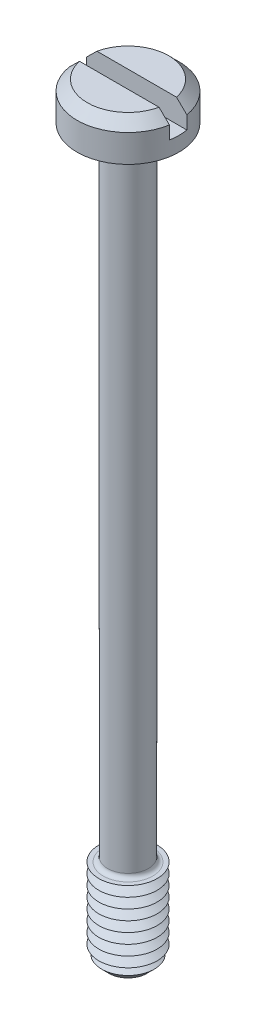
ISO-10303-21;
HEADER;
FILE_DESCRIPTION(('STEP AP214'),'2;1');
FILE_NAME('part.step','',(''),(''),'','','');
FILE_SCHEMA(('AUTOMOTIVE_DESIGN { 1 0 10303 214 1 1 1 1 }'));
ENDSEC;
DATA;
#1=APPLICATION_CONTEXT('core data for automotive mechanical design processes');
#2=APPLICATION_PROTOCOL_DEFINITION('international standard','automotive_design',2000,#1);
#3=PRODUCT_CONTEXT('',#1,'mechanical');
#4=PRODUCT('Part','Part','',(#3));
#5=PRODUCT_RELATED_PRODUCT_CATEGORY('part','',(#4));
#6=PRODUCT_DEFINITION_FORMATION('','',#4);
#7=PRODUCT_DEFINITION_CONTEXT('part definition',#1,'design');
#8=PRODUCT_DEFINITION('design','',#6,#7);
#9=PRODUCT_DEFINITION_SHAPE('','',#8);
#10=(LENGTH_UNIT() NAMED_UNIT(*) SI_UNIT(.MILLI.,.METRE.));
#11=(NAMED_UNIT(*) PLANE_ANGLE_UNIT() SI_UNIT($,.RADIAN.));
#12=(NAMED_UNIT(*) SI_UNIT($,.STERADIAN.) SOLID_ANGLE_UNIT());
#13=UNCERTAINTY_MEASURE_WITH_UNIT(LENGTH_MEASURE(1.E-05),#10,'distance_accuracy_value','');
#14=(GEOMETRIC_REPRESENTATION_CONTEXT(3) GLOBAL_UNCERTAINTY_ASSIGNED_CONTEXT((#13)) GLOBAL_UNIT_ASSIGNED_CONTEXT((#10,
#11,#12)) REPRESENTATION_CONTEXT('',''));
#15=CARTESIAN_POINT('',(0.,0.,0.));
#16=DIRECTION('',(0.,0.,1.));
#17=DIRECTION('',(1.,0.,0.));
#18=AXIS2_PLACEMENT_3D('',#15,#16,#17);
#19=CARTESIAN_POINT('',(0.,2.6,0.));
#20=DIRECTION('',(0.,1.,0.));
#21=DIRECTION('',(0.,0.,1.));
#22=AXIS2_PLACEMENT_3D('',#19,#20,#21);
#23=PLANE('',#22);
#24=DIRECTION('',(-1.,0.,0.));
#25=VECTOR('',#24,1.);
#26=CARTESIAN_POINT('',(3.5,2.6,-0.6));
#27=LINE('',#26,#25);
#28=CARTESIAN_POINT('',(2.73495886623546,2.6,-0.6));
#29=VERTEX_POINT('',#28);
#30=CARTESIAN_POINT('',(-2.73495886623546,2.6,-0.6));
#31=VERTEX_POINT('',#30);
#32=EDGE_CURVE('E110',#29,#31,#27,.T.);
#33=ORIENTED_EDGE('',*,*,#32,.F.);
#34=CARTESIAN_POINT('',(0.,2.6,0.));
#35=DIRECTION('',(0.,1.,0.));
#36=DIRECTION('',(0.,0.,1.));
#37=AXIS2_PLACEMENT_3D('',#34,#35,#36);
#38=CIRCLE('',#37,2.8);
#39=EDGE_CURVE('E113',#29,#31,#38,.T.);
#40=ORIENTED_EDGE('',*,*,#39,.T.);
#41=EDGE_LOOP('',(#33,#40));
#42=FACE_BOUND('',#41,.T.);
#43=ADVANCED_FACE('F39',(#42),#23,.T.);
#44=CARTESIAN_POINT('',(0.,2.6,0.));
#45=DIRECTION('',(0.,-1.,0.));
#46=DIRECTION('',(0.,0.,-1.));
#47=AXIS2_PLACEMENT_3D('',#44,#45,#46);
#48=CONICAL_SURFACE('',#47,2.8,0.785398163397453);
#49=CARTESIAN_POINT('',(7.69779986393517,-2.32114776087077,-0.6));
#50=CARTESIAN_POINT('',(7.4245634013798,-2.0487448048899,-0.6));
#51=CARTESIAN_POINT('',(7.15128998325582,-1.77637887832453,-0.6));
#52=CARTESIAN_POINT('',(6.60460779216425,-1.23176088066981,-0.6));
#53=CARTESIAN_POINT('',(6.33119901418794,-0.959508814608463,-0.6));
#54=CARTESIAN_POINT('',(5.78393918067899,-0.414914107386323,-0.6));
#55=CARTESIAN_POINT('',(5.51008795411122,-0.14257163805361,-0.6));
#56=CARTESIAN_POINT('',(4.96212493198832,0.401829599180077,-0.6));
#57=CARTESIAN_POINT('',(4.68801314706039,0.673888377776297,-0.6));
#58=CARTESIAN_POINT('',(4.15230810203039,1.204717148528,-0.6));
#59=CARTESIAN_POINT('',(3.89073524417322,1.4635077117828,-0.6));
#60=CARTESIAN_POINT('',(3.49781694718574,1.85115830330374,-0.6));
#61=CARTESIAN_POINT('',(3.36674319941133,1.98029362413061,-0.6));
#62=CARTESIAN_POINT('',(3.10433907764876,2.23830030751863,-0.6));
#63=CARTESIAN_POINT('',(2.97300870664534,2.36717167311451,-0.6));
#64=CARTESIAN_POINT('',(2.71005235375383,2.62445652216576,-0.6));
#65=CARTESIAN_POINT('',(2.57842659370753,2.75287023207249,-0.6));
#66=CARTESIAN_POINT('',(2.31459302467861,3.00911021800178,-0.6));
#67=CARTESIAN_POINT('',(2.1823851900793,3.13693646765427,-0.6));
#68=CARTESIAN_POINT('',(1.91706128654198,3.39159289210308,-0.6));
#69=CARTESIAN_POINT('',(1.78394541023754,3.51842326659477,-0.6));
#70=CARTESIAN_POINT('',(1.58297454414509,3.70728046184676,-0.6));
#71=CARTESIAN_POINT('',(1.51577053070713,3.76999922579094,-0.6));
#72=CARTESIAN_POINT('',(1.38073587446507,3.89475766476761,-0.6));
#73=CARTESIAN_POINT('',(1.31290524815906,3.95679735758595,-0.6));
#74=CARTESIAN_POINT('',(1.2066236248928,4.05253127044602,-0.6));
#75=CARTESIAN_POINT('',(1.16849592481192,4.08658409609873,-0.6));
#76=CARTESIAN_POINT('',(1.09186306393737,4.15427097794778,-0.6));
#77=CARTESIAN_POINT('',(1.05335786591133,4.18790499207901,-0.6));
#78=CARTESIAN_POINT('',(0.975560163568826,4.25487029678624,-0.6));
#79=CARTESIAN_POINT('',(0.93626386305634,4.28819718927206,-0.6));
#80=CARTESIAN_POINT('',(0.857023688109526,4.35405392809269,-0.6));
#81=CARTESIAN_POINT('',(0.817079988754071,4.38658398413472,-0.6));
#82=CARTESIAN_POINT('',(0.735932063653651,4.45080389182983,-0.6));
#83=CARTESIAN_POINT('',(0.694719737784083,4.48248357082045,-0.6));
#84=CARTESIAN_POINT('',(0.611023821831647,4.54411116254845,-0.6));
#85=CARTESIAN_POINT('',(0.568540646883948,4.57405963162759,-0.6));
#86=CARTESIAN_POINT('',(0.482031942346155,4.6310413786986,-0.6));
#87=CARTESIAN_POINT('',(0.438018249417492,4.6580923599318,-0.6));
#88=CARTESIAN_POINT('',(0.347545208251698,4.70764477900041,-0.6));
#89=CARTESIAN_POINT('',(0.301093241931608,4.73015905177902,-0.6));
#90=CARTESIAN_POINT('',(0.216840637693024,4.76288589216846,-0.6));
#91=CARTESIAN_POINT('',(0.179711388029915,4.7747611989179,-0.6));
#92=CARTESIAN_POINT('',(0.104069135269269,4.79214056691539,-0.6));
#93=CARTESIAN_POINT('',(0.06556300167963,4.79767265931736,-0.6));
#94=CARTESIAN_POINT('',(-0.012108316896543,4.80113734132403,-0.6));
#95=CARTESIAN_POINT('',(-0.0512762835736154,4.79901215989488,-0.6));
#96=CARTESIAN_POINT('',(-0.128601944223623,4.7875810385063,-0.6));
#97=CARTESIAN_POINT('',(-0.166755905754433,4.77825158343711,-0.6));
#98=CARTESIAN_POINT('',(-0.239985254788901,4.75468984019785,-0.6));
#99=CARTESIAN_POINT('',(-0.275121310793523,4.74063623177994,-0.6));
#100=CARTESIAN_POINT('',(-0.34385962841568,4.70912771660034,-0.6));
#101=CARTESIAN_POINT('',(-0.377459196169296,4.69166709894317,-0.6));
#102=CARTESIAN_POINT('',(-0.443620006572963,4.65431398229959,-0.6));
#103=CARTESIAN_POINT('',(-0.476170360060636,4.63440256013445,-0.6));
#104=CARTESIAN_POINT('',(-0.540208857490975,4.59301144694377,-0.6));
#105=CARTESIAN_POINT('',(-0.571697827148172,4.57153301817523,-0.6));
#106=CARTESIAN_POINT('',(-0.636426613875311,4.52565712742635,-0.6));
#107=CARTESIAN_POINT('',(-0.669598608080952,4.50116466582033,-0.6));
#108=CARTESIAN_POINT('',(-0.735238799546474,4.45125092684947,-0.6));
#109=CARTESIAN_POINT('',(-0.767706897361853,4.42582951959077,-0.6));
#110=CARTESIAN_POINT('',(-0.864340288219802,4.34853769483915,-0.6));
#111=CARTESIAN_POINT('',(-0.92770092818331,4.29566444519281,-0.6));
#112=CARTESIAN_POINT('',(-1.0532203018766,4.18829389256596,-0.6));
#113=CARTESIAN_POINT('',(-1.11537654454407,4.13379371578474,-0.6));
#114=CARTESIAN_POINT('',(-1.2387980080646,4.02383276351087,-0.6));
#115=CARTESIAN_POINT('',(-1.30006349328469,3.9683722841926,-0.6));
#116=CARTESIAN_POINT('',(-1.42182653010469,3.85695373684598,-0.6));
#117=CARTESIAN_POINT('',(-1.48232573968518,3.80099747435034,-0.6));
#118=CARTESIAN_POINT('',(-1.60290045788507,3.68862177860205,-0.6));
#119=CARTESIAN_POINT('',(-1.66297593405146,3.63220231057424,-0.6));
#120=CARTESIAN_POINT('',(-1.84259490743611,3.46258196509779,-0.6));
#121=CARTESIAN_POINT('',(-1.96167258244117,3.34888831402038,-0.6));
#122=CARTESIAN_POINT('',(-2.19942862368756,3.12043467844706,-0.6));
#123=CARTESIAN_POINT('',(-2.31810499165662,3.00567262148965,-0.6));
#124=CARTESIAN_POINT('',(-2.5549851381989,2.77566147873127,-0.6));
#125=CARTESIAN_POINT('',(-2.67318891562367,2.66041239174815,-0.6));
#126=CARTESIAN_POINT('',(-3.02733776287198,2.31418176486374,-0.6));
#127=CARTESIAN_POINT('',(-3.26281496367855,2.08272206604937,-0.6));
#128=CARTESIAN_POINT('',(-3.73326607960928,1.61902814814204,-0.6));
#129=CARTESIAN_POINT('',(-3.96823963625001,1.38679356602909,-0.6));
#130=CARTESIAN_POINT('',(-4.43780370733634,0.921942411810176,-0.6));
#131=CARTESIAN_POINT('',(-4.67239422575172,0.689325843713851,-0.6));
#132=CARTESIAN_POINT('',(-5.13982382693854,0.225350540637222,-0.6));
#133=CARTESIAN_POINT('',(-5.37266445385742,-0.00600663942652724,-0.6));
#134=CARTESIAN_POINT('',(-5.83818541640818,-0.468883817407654,-0.6));
#135=CARTESIAN_POINT('',(-6.07086575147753,-0.700403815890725,-0.6));
#136=CARTESIAN_POINT('',(-6.53596926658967,-1.16341429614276,-0.6));
#137=CARTESIAN_POINT('',(-6.76839251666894,-1.39490470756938,-0.6));
#138=CARTESIAN_POINT('',(-7.23315324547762,-1.85796986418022,-0.6));
#139=CARTESIAN_POINT('',(-7.46549072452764,-2.08954460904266,-0.6));
#140=CARTESIAN_POINT('',(-7.69779986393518,-2.32114776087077,-0.6));
#141=B_SPLINE_CURVE_WITH_KNOTS('',3,(#49,#50,#51,#52,#53,#54,#55,#56,#57,#58,#59,#60,#61,#62,
#63,#64,#65,#66,#67,#68,#69,#70,#71,#72,#73,#74,#75,#76,#77,#78,#79,#80,#81,#82,#83,#84,#85,#86,
#87,#88,#89,#90,#91,#92,#93,#94,#95,#96,#97,#98,#99,#100,#101,#102,#103,#104,#105,#106,#107,
#108,#109,#110,#111,#112,#113,#114,#115,#116,#117,#118,#119,#120,#121,#122,#123,#124,#125,#126,
#127,#128,#129,#130,#131,#132,#133,#134,#135,#136,#137,#138,#139,#140),.UNSPECIFIED.,.F.,.F.,(4,
2,2,2,2,2,2,2,2,2,2,2,2,2,2,2,2,2,2,2,2,2,2,2,2,2,2,2,2,2,2,2,2,2,2,2,2,2,2,2,2,2,2,2,2,4),(0.,
1.15747738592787,2.31500139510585,3.47365747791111,4.63226817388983,5.73614050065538,
6.288142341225,6.84013779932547,7.39180548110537,7.9434976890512,8.49507629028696,
8.77084567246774,9.04660781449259,9.19996738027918,9.35334222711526,9.50791164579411,
9.66243993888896,9.81835637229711,9.97422241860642,10.1290741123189,10.2834813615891,
10.4000294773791,10.5160605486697,10.6329688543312,10.7502603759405,10.8635386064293,
10.9770083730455,11.0914168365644,11.205734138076,11.3294140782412,11.4531113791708,
11.7006314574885,11.9486181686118,12.1965297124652,12.4437540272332,12.6909970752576,
13.1849047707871,13.6801705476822,14.1754375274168,15.1659939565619,16.1571087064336,
17.1482131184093,18.1329303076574,19.1176509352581,20.1017623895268,21.0858701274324),.UNSPECIFIED.);
#142=CARTESIAN_POINT('',(3.44818792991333,1.9,-0.6));
#143=VERTEX_POINT('',#142);
#144=EDGE_CURVE('E260',#143,#29,#141,.T.);
#145=ORIENTED_EDGE('',*,*,#144,.F.);
#146=CARTESIAN_POINT('',(0.,1.9,0.));
#147=DIRECTION('',(0.,1.,0.));
#148=DIRECTION('',(0.,0.,1.));
#149=AXIS2_PLACEMENT_3D('',#146,#147,#148);
#150=CIRCLE('',#149,3.5);
#151=CARTESIAN_POINT('',(-3.44818792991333,1.9,-0.6));
#152=VERTEX_POINT('',#151);
#153=EDGE_CURVE('E128',#152,#143,#150,.F.);
#154=ORIENTED_EDGE('',*,*,#153,.F.);
#155=EDGE_CURVE('E102',#31,#152,#141,.T.);
#156=ORIENTED_EDGE('',*,*,#155,.F.);
#157=ORIENTED_EDGE('',*,*,#39,.F.);
#158=EDGE_LOOP('',(#145,#154,#156,#157));
#159=FACE_BOUND('',#158,.T.);
#160=ADVANCED_FACE('F222',(#159),#48,.T.);
#161=CARTESIAN_POINT('',(0.,-50.,0.));
#162=DIRECTION('',(0.,1.,0.));
#163=DIRECTION('',(0.,0.,1.));
#164=AXIS2_PLACEMENT_3D('',#161,#162,#163);
#165=CYLINDRICAL_SURFACE('',#164,1.4);
#166=CARTESIAN_POINT('',(0.,-43.7,0.));
#167=DIRECTION('',(0.,-1.,0.));
#168=DIRECTION('',(0.,0.,-1.));
#169=AXIS2_PLACEMENT_3D('',#166,#167,#168);
#170=CIRCLE('',#169,1.4);
#171=CARTESIAN_POINT('',(0.,-43.7,-1.4));
#172=VERTEX_POINT('',#171);
#173=EDGE_CURVE('E123',#172,#172,#170,.F.);
#174=ORIENTED_EDGE('',*,*,#173,.T.);
#175=EDGE_LOOP('',(#174));
#176=FACE_BOUND('',#175,.T.);
#177=CARTESIAN_POINT('',(0.,-0.300000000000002,0.));
#178=DIRECTION('',(0.,1.,0.));
#179=DIRECTION('',(0.,0.,1.));
#180=AXIS2_PLACEMENT_3D('',#177,#178,#179);
#181=CIRCLE('',#180,1.4);
#182=CARTESIAN_POINT('',(0.,-0.300000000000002,1.4));
#183=VERTEX_POINT('',#182);
#184=EDGE_CURVE('E366',#183,#183,#181,.F.);
#185=ORIENTED_EDGE('',*,*,#184,.T.);
#186=EDGE_LOOP('',(#185));
#187=FACE_BOUND('',#186,.T.);
#188=ADVANCED_FACE('F218',(#176,#187),#165,.T.);
#189=CARTESIAN_POINT('',(0.,2.6,0.));
#190=DIRECTION('',(0.,-1.,0.));
#191=DIRECTION('',(0.,0.,-1.));
#192=AXIS2_PLACEMENT_3D('',#189,#190,#191);
#193=CYLINDRICAL_SURFACE('',#192,3.5);
#194=ORIENTED_EDGE('',*,*,#153,.T.);
#195=DIRECTION('',(0.,-1.,0.));
#196=VECTOR('',#195,1.);
#197=CARTESIAN_POINT('',(3.44818792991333,2.6,-0.6));
#198=LINE('',#197,#196);
#199=CARTESIAN_POINT('',(3.44818792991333,1.,-0.6));
#200=VERTEX_POINT('',#199);
#201=EDGE_CURVE('E64',#143,#200,#198,.T.);
#202=ORIENTED_EDGE('',*,*,#201,.T.);
#203=CARTESIAN_POINT('',(0.,1.,0.));
#204=DIRECTION('',(0.,1.,0.));
#205=DIRECTION('',(0.,0.,1.));
#206=AXIS2_PLACEMENT_3D('',#203,#204,#205);
#207=CIRCLE('',#206,3.5);
#208=CARTESIAN_POINT('',(3.44818792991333,1.,0.6));
#209=VERTEX_POINT('',#208);
#210=EDGE_CURVE('E11',#209,#200,#207,.T.);
#211=ORIENTED_EDGE('',*,*,#210,.F.);
#212=DIRECTION('',(0.,-1.,0.));
#213=VECTOR('',#212,1.);
#214=CARTESIAN_POINT('',(3.44818792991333,2.6,0.6));
#215=LINE('',#214,#213);
#216=CARTESIAN_POINT('',(3.44818792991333,1.9,0.6));
#217=VERTEX_POINT('',#216);
#218=EDGE_CURVE('E278',#209,#217,#215,.F.);
#219=ORIENTED_EDGE('',*,*,#218,.T.);
#220=CARTESIAN_POINT('',(-3.44818792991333,1.9,0.6));
#221=VERTEX_POINT('',#220);
#222=EDGE_CURVE('E120',#217,#221,#150,.F.);
#223=ORIENTED_EDGE('',*,*,#222,.T.);
#224=DIRECTION('',(0.,-1.,0.));
#225=VECTOR('',#224,1.);
#226=CARTESIAN_POINT('',(-3.44818792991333,2.6,0.6));
#227=LINE('',#226,#225);
#228=CARTESIAN_POINT('',(-3.44818792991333,1.,0.6));
#229=VERTEX_POINT('',#228);
#230=EDGE_CURVE('E96',#221,#229,#227,.T.);
#231=ORIENTED_EDGE('',*,*,#230,.T.);
#232=CARTESIAN_POINT('',(-3.44818792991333,1.,-0.6));
#233=VERTEX_POINT('',#232);
#234=EDGE_CURVE('E44',#233,#229,#207,.T.);
#235=ORIENTED_EDGE('',*,*,#234,.F.);
#236=DIRECTION('',(0.,-1.,0.));
#237=VECTOR('',#236,1.);
#238=CARTESIAN_POINT('',(-3.44818792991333,2.6,-0.6));
#239=LINE('',#238,#237);
#240=EDGE_CURVE('E283',#233,#152,#239,.F.);
#241=ORIENTED_EDGE('',*,*,#240,.T.);
#242=EDGE_LOOP('',(#194,#202,#211,#219,#223,#231,#235,#241));
#243=FACE_BOUND('',#242,.T.);
#244=CARTESIAN_POINT('',(0.,0.,0.));
#245=DIRECTION('',(0.,1.,0.));
#246=DIRECTION('',(0.,0.,1.));
#247=AXIS2_PLACEMENT_3D('',#244,#245,#246);
#248=CIRCLE('',#247,3.5);
#249=CARTESIAN_POINT('',(0.,0.,3.5));
#250=VERTEX_POINT('',#249);
#251=EDGE_CURVE('E351',#250,#250,#248,.T.);
#252=ORIENTED_EDGE('',*,*,#251,.T.);
#253=EDGE_LOOP('',(#252));
#254=FACE_BOUND('',#253,.T.);
#255=ADVANCED_FACE('F221',(#243,#254),#193,.T.);
#256=DIRECTION('',(1.,0.,0.));
#257=VECTOR('',#256,1.);
#258=CARTESIAN_POINT('',(3.5,2.6,0.6));
#259=LINE('',#258,#257);
#260=CARTESIAN_POINT('',(-2.73495886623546,2.6,0.6));
#261=VERTEX_POINT('',#260);
#262=CARTESIAN_POINT('',(2.73495886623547,2.6,0.6));
#263=VERTEX_POINT('',#262);
#264=EDGE_CURVE('E56',#261,#263,#259,.T.);
#265=ORIENTED_EDGE('',*,*,#264,.F.);
#266=EDGE_CURVE('E108',#261,#263,#38,.T.);
#267=ORIENTED_EDGE('',*,*,#266,.T.);
#268=EDGE_LOOP('',(#265,#267));
#269=FACE_BOUND('',#268,.T.);
#270=ADVANCED_FACE('F107',(#269),#23,.T.);
#271=CARTESIAN_POINT('',(0.,0.,0.));
#272=DIRECTION('',(0.,1.,0.));
#273=DIRECTION('',(0.,0.,1.));
#274=AXIS2_PLACEMENT_3D('',#271,#272,#273);
#275=PLANE('',#274);
#276=CARTESIAN_POINT('',(0.,0.,0.));
#277=DIRECTION('',(0.,1.,0.));
#278=DIRECTION('',(0.,0.,1.));
#279=AXIS2_PLACEMENT_3D('',#276,#277,#278);
#280=CIRCLE('',#279,1.7);
#281=CARTESIAN_POINT('',(0.,0.,1.7));
#282=VERTEX_POINT('',#281);
#283=EDGE_CURVE('E114',#282,#282,#280,.T.);
#284=ORIENTED_EDGE('',*,*,#283,.T.);
#285=EDGE_LOOP('',(#284));
#286=FACE_BOUND('',#285,.T.);
#287=ORIENTED_EDGE('',*,*,#251,.F.);
#288=EDGE_LOOP('',(#287));
#289=FACE_BOUND('',#288,.T.);
#290=ADVANCED_FACE('F212',(#286,#289),#275,.F.);
#291=CARTESIAN_POINT('',(0.,-44.,0.));
#292=DIRECTION('',(0.,-1.,0.));
#293=DIRECTION('',(0.,0.,-1.));
#294=AXIS2_PLACEMENT_3D('',#291,#292,#293);
#295=PLANE('',#294);
#296=CARTESIAN_POINT('',(0.,-44.,0.));
#297=DIRECTION('',(0.,-1.,0.));
#298=DIRECTION('',(0.,0.,-1.));
#299=AXIS2_PLACEMENT_3D('',#296,#297,#298);
#300=CIRCLE('',#299,1.7);
#301=CARTESIAN_POINT('',(0.,-44.,-1.7));
#302=VERTEX_POINT('',#301);
#303=EDGE_CURVE('E359',#302,#302,#300,.T.);
#304=ORIENTED_EDGE('',*,*,#303,.T.);
#305=EDGE_LOOP('',(#304));
#306=FACE_BOUND('',#305,.T.);
#307=CARTESIAN_POINT('',(0.,-44.,0.));
#308=DIRECTION('',(0.,1.,0.));
#309=DIRECTION('',(0.,0.,1.));
#310=AXIS2_PLACEMENT_3D('',#307,#308,#309);
#311=CIRCLE('',#310,2.);
#312=CARTESIAN_POINT('',(0.,-44.,2.));
#313=VERTEX_POINT('',#312);
#314=EDGE_CURVE('E348',#313,#313,#311,.T.);
#315=ORIENTED_EDGE('',*,*,#314,.T.);
#316=EDGE_LOOP('',(#315));
#317=FACE_BOUND('',#316,.T.);
#318=ADVANCED_FACE('F208',(#306,#317),#295,.F.);
#319=CARTESIAN_POINT('',(0.,-44.35,0.));
#320=DIRECTION('',(0.,1.,0.));
#321=DIRECTION('',(0.,0.,1.));
#322=AXIS2_PLACEMENT_3D('',#319,#320,#321);
#323=CONICAL_SURFACE('',#322,1.39378221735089,1.0471975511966);
#324=ORIENTED_EDGE('',*,*,#314,.F.);
#325=EDGE_LOOP('',(#324));
#326=FACE_BOUND('',#325,.T.);
#327=CARTESIAN_POINT('',(0.,-44.35,0.));
#328=DIRECTION('',(0.,1.,0.));
#329=DIRECTION('',(0.,0.,1.));
#330=AXIS2_PLACEMENT_3D('',#327,#328,#329);
#331=CIRCLE('',#330,1.39378221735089);
#332=CARTESIAN_POINT('',(0.,-44.35,1.39378221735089));
#333=VERTEX_POINT('',#332);
#334=EDGE_CURVE('E345',#333,#333,#331,.T.);
#335=ORIENTED_EDGE('',*,*,#334,.T.);
#336=EDGE_LOOP('',(#335));
#337=FACE_BOUND('',#336,.T.);
#338=ADVANCED_FACE('F204',(#326,#337),#323,.T.);
#339=CARTESIAN_POINT('',(0.,-44.7,0.));
#340=DIRECTION('',(0.,-1.,0.));
#341=DIRECTION('',(0.,0.,-1.));
#342=AXIS2_PLACEMENT_3D('',#339,#340,#341);
#343=CONICAL_SURFACE('',#342,2.,1.04719755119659);
#344=ORIENTED_EDGE('',*,*,#334,.F.);
#345=EDGE_LOOP('',(#344));
#346=FACE_BOUND('',#345,.T.);
#347=CARTESIAN_POINT('',(0.,-44.7,0.));
#348=DIRECTION('',(0.,1.,0.));
#349=DIRECTION('',(0.,0.,1.));
#350=AXIS2_PLACEMENT_3D('',#347,#348,#349);
#351=CIRCLE('',#350,2.);
#352=CARTESIAN_POINT('',(0.,-44.7,2.));
#353=VERTEX_POINT('',#352);
#354=EDGE_CURVE('E341',#353,#353,#351,.T.);
#355=ORIENTED_EDGE('',*,*,#354,.T.);
#356=EDGE_LOOP('',(#355));
#357=FACE_BOUND('',#356,.T.);
#358=ADVANCED_FACE('F200',(#346,#357),#343,.T.);
#359=CARTESIAN_POINT('',(0.,-45.05,0.));
#360=DIRECTION('',(0.,1.,0.));
#361=DIRECTION('',(0.,0.,1.));
#362=AXIS2_PLACEMENT_3D('',#359,#360,#361);
#363=CONICAL_SURFACE('',#362,1.39378221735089,1.0471975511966);
#364=ORIENTED_EDGE('',*,*,#354,.F.);
#365=EDGE_LOOP('',(#364));
#366=FACE_BOUND('',#365,.T.);
#367=CARTESIAN_POINT('',(0.,-45.05,0.));
#368=DIRECTION('',(0.,1.,0.));
#369=DIRECTION('',(0.,0.,1.));
#370=AXIS2_PLACEMENT_3D('',#367,#368,#369);
#371=CIRCLE('',#370,1.39378221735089);
#372=CARTESIAN_POINT('',(0.,-45.05,1.39378221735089));
#373=VERTEX_POINT('',#372);
#374=EDGE_CURVE('E337',#373,#373,#371,.T.);
#375=ORIENTED_EDGE('',*,*,#374,.T.);
#376=EDGE_LOOP('',(#375));
#377=FACE_BOUND('',#376,.T.);
#378=ADVANCED_FACE('F196',(#366,#377),#363,.T.);
#379=CARTESIAN_POINT('',(0.,-45.4,0.));
#380=DIRECTION('',(0.,-1.,0.));
#381=DIRECTION('',(0.,0.,-1.));
#382=AXIS2_PLACEMENT_3D('',#379,#380,#381);
#383=CONICAL_SURFACE('',#382,2.,1.04719755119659);
#384=ORIENTED_EDGE('',*,*,#374,.F.);
#385=EDGE_LOOP('',(#384));
#386=FACE_BOUND('',#385,.T.);
#387=CARTESIAN_POINT('',(0.,-45.4,0.));
#388=DIRECTION('',(0.,1.,0.));
#389=DIRECTION('',(0.,0.,1.));
#390=AXIS2_PLACEMENT_3D('',#387,#388,#389);
#391=CIRCLE('',#390,2.);
#392=CARTESIAN_POINT('',(0.,-45.4,2.));
#393=VERTEX_POINT('',#392);
#394=EDGE_CURVE('E334',#393,#393,#391,.T.);
#395=ORIENTED_EDGE('',*,*,#394,.T.);
#396=EDGE_LOOP('',(#395));
#397=FACE_BOUND('',#396,.T.);
#398=ADVANCED_FACE('F192',(#386,#397),#383,.T.);
#399=CARTESIAN_POINT('',(0.,-45.75,0.));
#400=DIRECTION('',(0.,1.,0.));
#401=DIRECTION('',(0.,0.,1.));
#402=AXIS2_PLACEMENT_3D('',#399,#400,#401);
#403=CONICAL_SURFACE('',#402,1.39378221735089,1.0471975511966);
#404=ORIENTED_EDGE('',*,*,#394,.F.);
#405=EDGE_LOOP('',(#404));
#406=FACE_BOUND('',#405,.T.);
#407=CARTESIAN_POINT('',(0.,-45.75,0.));
#408=DIRECTION('',(0.,1.,0.));
#409=DIRECTION('',(0.,0.,1.));
#410=AXIS2_PLACEMENT_3D('',#407,#408,#409);
#411=CIRCLE('',#410,1.39378221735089);
#412=CARTESIAN_POINT('',(0.,-45.75,1.39378221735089));
#413=VERTEX_POINT('',#412);
#414=EDGE_CURVE('E330',#413,#413,#411,.T.);
#415=ORIENTED_EDGE('',*,*,#414,.T.);
#416=EDGE_LOOP('',(#415));
#417=FACE_BOUND('',#416,.T.);
#418=ADVANCED_FACE('F188',(#406,#417),#403,.T.);
#419=CARTESIAN_POINT('',(0.,-46.1,0.));
#420=DIRECTION('',(0.,-1.,0.));
#421=DIRECTION('',(0.,0.,-1.));
#422=AXIS2_PLACEMENT_3D('',#419,#420,#421);
#423=CONICAL_SURFACE('',#422,2.,1.04719755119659);
#424=ORIENTED_EDGE('',*,*,#414,.F.);
#425=EDGE_LOOP('',(#424));
#426=FACE_BOUND('',#425,.T.);
#427=CARTESIAN_POINT('',(0.,-46.1,0.));
#428=DIRECTION('',(0.,1.,0.));
#429=DIRECTION('',(0.,0.,1.));
#430=AXIS2_PLACEMENT_3D('',#427,#428,#429);
#431=CIRCLE('',#430,2.);
#432=CARTESIAN_POINT('',(0.,-46.1,2.));
#433=VERTEX_POINT('',#432);
#434=EDGE_CURVE('E326',#433,#433,#431,.T.);
#435=ORIENTED_EDGE('',*,*,#434,.T.);
#436=EDGE_LOOP('',(#435));
#437=FACE_BOUND('',#436,.T.);
#438=ADVANCED_FACE('F184',(#426,#437),#423,.T.);
#439=CARTESIAN_POINT('',(0.,-46.45,0.));
#440=DIRECTION('',(0.,1.,0.));
#441=DIRECTION('',(0.,0.,1.));
#442=AXIS2_PLACEMENT_3D('',#439,#440,#441);
#443=CONICAL_SURFACE('',#442,1.39378221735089,1.0471975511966);
#444=ORIENTED_EDGE('',*,*,#434,.F.);
#445=EDGE_LOOP('',(#444));
#446=FACE_BOUND('',#445,.T.);
#447=CARTESIAN_POINT('',(0.,-46.45,0.));
#448=DIRECTION('',(0.,1.,0.));
#449=DIRECTION('',(0.,0.,1.));
#450=AXIS2_PLACEMENT_3D('',#447,#448,#449);
#451=CIRCLE('',#450,1.39378221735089);
#452=CARTESIAN_POINT('',(0.,-46.45,1.39378221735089));
#453=VERTEX_POINT('',#452);
#454=EDGE_CURVE('E322',#453,#453,#451,.T.);
#455=ORIENTED_EDGE('',*,*,#454,.T.);
#456=EDGE_LOOP('',(#455));
#457=FACE_BOUND('',#456,.T.);
#458=ADVANCED_FACE('F180',(#446,#457),#443,.T.);
#459=CARTESIAN_POINT('',(0.,-46.8,0.));
#460=DIRECTION('',(0.,-1.,0.));
#461=DIRECTION('',(0.,0.,-1.));
#462=AXIS2_PLACEMENT_3D('',#459,#460,#461);
#463=CONICAL_SURFACE('',#462,2.,1.04719755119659);
#464=ORIENTED_EDGE('',*,*,#454,.F.);
#465=EDGE_LOOP('',(#464));
#466=FACE_BOUND('',#465,.T.);
#467=CARTESIAN_POINT('',(0.,-46.8,0.));
#468=DIRECTION('',(0.,1.,0.));
#469=DIRECTION('',(0.,0.,1.));
#470=AXIS2_PLACEMENT_3D('',#467,#468,#469);
#471=CIRCLE('',#470,2.);
#472=CARTESIAN_POINT('',(0.,-46.8,2.));
#473=VERTEX_POINT('',#472);
#474=EDGE_CURVE('E318',#473,#473,#471,.T.);
#475=ORIENTED_EDGE('',*,*,#474,.T.);
#476=EDGE_LOOP('',(#475));
#477=FACE_BOUND('',#476,.T.);
#478=ADVANCED_FACE('F176',(#466,#477),#463,.T.);
#479=CARTESIAN_POINT('',(0.,-47.15,0.));
#480=DIRECTION('',(0.,1.,0.));
#481=DIRECTION('',(0.,0.,1.));
#482=AXIS2_PLACEMENT_3D('',#479,#480,#481);
#483=CONICAL_SURFACE('',#482,1.39378221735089,1.0471975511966);
#484=ORIENTED_EDGE('',*,*,#474,.F.);
#485=EDGE_LOOP('',(#484));
#486=FACE_BOUND('',#485,.T.);
#487=CARTESIAN_POINT('',(0.,-47.15,0.));
#488=DIRECTION('',(0.,1.,0.));
#489=DIRECTION('',(0.,0.,1.));
#490=AXIS2_PLACEMENT_3D('',#487,#488,#489);
#491=CIRCLE('',#490,1.39378221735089);
#492=CARTESIAN_POINT('',(0.,-47.15,1.39378221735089));
#493=VERTEX_POINT('',#492);
#494=EDGE_CURVE('E315',#493,#493,#491,.T.);
#495=ORIENTED_EDGE('',*,*,#494,.T.);
#496=EDGE_LOOP('',(#495));
#497=FACE_BOUND('',#496,.T.);
#498=ADVANCED_FACE('F172',(#486,#497),#483,.T.);
#499=CARTESIAN_POINT('',(0.,-47.5,0.));
#500=DIRECTION('',(0.,-1.,0.));
#501=DIRECTION('',(0.,0.,-1.));
#502=AXIS2_PLACEMENT_3D('',#499,#500,#501);
#503=CONICAL_SURFACE('',#502,2.,1.04719755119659);
#504=ORIENTED_EDGE('',*,*,#494,.F.);
#505=EDGE_LOOP('',(#504));
#506=FACE_BOUND('',#505,.T.);
#507=CARTESIAN_POINT('',(0.,-47.5,0.));
#508=DIRECTION('',(0.,1.,0.));
#509=DIRECTION('',(0.,0.,1.));
#510=AXIS2_PLACEMENT_3D('',#507,#508,#509);
#511=CIRCLE('',#510,2.);
#512=CARTESIAN_POINT('',(0.,-47.5,2.));
#513=VERTEX_POINT('',#512);
#514=EDGE_CURVE('E311',#513,#513,#511,.T.);
#515=ORIENTED_EDGE('',*,*,#514,.T.);
#516=EDGE_LOOP('',(#515));
#517=FACE_BOUND('',#516,.T.);
#518=ADVANCED_FACE('F168',(#506,#517),#503,.T.);
#519=CARTESIAN_POINT('',(0.,-47.85,0.));
#520=DIRECTION('',(0.,1.,0.));
#521=DIRECTION('',(0.,0.,1.));
#522=AXIS2_PLACEMENT_3D('',#519,#520,#521);
#523=CONICAL_SURFACE('',#522,1.39378221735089,1.0471975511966);
#524=ORIENTED_EDGE('',*,*,#514,.F.);
#525=EDGE_LOOP('',(#524));
#526=FACE_BOUND('',#525,.T.);
#527=CARTESIAN_POINT('',(0.,-47.85,0.));
#528=DIRECTION('',(0.,1.,0.));
#529=DIRECTION('',(0.,0.,1.));
#530=AXIS2_PLACEMENT_3D('',#527,#528,#529);
#531=CIRCLE('',#530,1.39378221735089);
#532=CARTESIAN_POINT('',(0.,-47.85,1.39378221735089));
#533=VERTEX_POINT('',#532);
#534=EDGE_CURVE('E308',#533,#533,#531,.T.);
#535=ORIENTED_EDGE('',*,*,#534,.T.);
#536=EDGE_LOOP('',(#535));
#537=FACE_BOUND('',#536,.T.);
#538=ADVANCED_FACE('F164',(#526,#537),#523,.T.);
#539=CARTESIAN_POINT('',(0.,-48.2,0.));
#540=DIRECTION('',(0.,-1.,0.));
#541=DIRECTION('',(0.,0.,-1.));
#542=AXIS2_PLACEMENT_3D('',#539,#540,#541);
#543=CONICAL_SURFACE('',#542,2.,1.04719755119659);
#544=ORIENTED_EDGE('',*,*,#534,.F.);
#545=EDGE_LOOP('',(#544));
#546=FACE_BOUND('',#545,.T.);
#547=CARTESIAN_POINT('',(0.,-48.2,0.));
#548=DIRECTION('',(0.,1.,0.));
#549=DIRECTION('',(0.,0.,1.));
#550=AXIS2_PLACEMENT_3D('',#547,#548,#549);
#551=CIRCLE('',#550,2.);
#552=CARTESIAN_POINT('',(0.,-48.2,2.));
#553=VERTEX_POINT('',#552);
#554=EDGE_CURVE('E304',#553,#553,#551,.T.);
#555=ORIENTED_EDGE('',*,*,#554,.T.);
#556=EDGE_LOOP('',(#555));
#557=FACE_BOUND('',#556,.T.);
#558=ADVANCED_FACE('F160',(#546,#557),#543,.T.);
#559=CARTESIAN_POINT('',(0.,-48.55,0.));
#560=DIRECTION('',(0.,1.,0.));
#561=DIRECTION('',(0.,0.,1.));
#562=AXIS2_PLACEMENT_3D('',#559,#560,#561);
#563=CONICAL_SURFACE('',#562,1.39378221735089,1.0471975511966);
#564=ORIENTED_EDGE('',*,*,#554,.F.);
#565=EDGE_LOOP('',(#564));
#566=FACE_BOUND('',#565,.T.);
#567=CARTESIAN_POINT('',(0.,-48.55,0.));
#568=DIRECTION('',(0.,1.,0.));
#569=DIRECTION('',(0.,0.,1.));
#570=AXIS2_PLACEMENT_3D('',#567,#568,#569);
#571=CIRCLE('',#570,1.39378221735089);
#572=CARTESIAN_POINT('',(0.,-48.55,1.39378221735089));
#573=VERTEX_POINT('',#572);
#574=EDGE_CURVE('E300',#573,#573,#571,.T.);
#575=ORIENTED_EDGE('',*,*,#574,.T.);
#576=EDGE_LOOP('',(#575));
#577=FACE_BOUND('',#576,.T.);
#578=ADVANCED_FACE('F156',(#566,#577),#563,.T.);
#579=CARTESIAN_POINT('',(0.,-48.9,0.));
#580=DIRECTION('',(0.,-1.,0.));
#581=DIRECTION('',(0.,0.,-1.));
#582=AXIS2_PLACEMENT_3D('',#579,#580,#581);
#583=CONICAL_SURFACE('',#582,2.,1.04719755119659);
#584=ORIENTED_EDGE('',*,*,#574,.F.);
#585=EDGE_LOOP('',(#584));
#586=FACE_BOUND('',#585,.T.);
#587=CARTESIAN_POINT('',(0.,-48.9,0.));
#588=DIRECTION('',(0.,1.,0.));
#589=DIRECTION('',(0.,0.,1.));
#590=AXIS2_PLACEMENT_3D('',#587,#588,#589);
#591=CIRCLE('',#590,2.);
#592=CARTESIAN_POINT('',(0.,-48.9,2.));
#593=VERTEX_POINT('',#592);
#594=EDGE_CURVE('E295',#593,#593,#591,.T.);
#595=ORIENTED_EDGE('',*,*,#594,.T.);
#596=EDGE_LOOP('',(#595));
#597=FACE_BOUND('',#596,.T.);
#598=ADVANCED_FACE('F152',(#586,#597),#583,.T.);
#599=CARTESIAN_POINT('',(0.,-49.25,0.));
#600=DIRECTION('',(0.,1.,0.));
#601=DIRECTION('',(0.,0.,1.));
#602=AXIS2_PLACEMENT_3D('',#599,#600,#601);
#603=CONICAL_SURFACE('',#602,1.39378221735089,1.0471975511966);
#604=ORIENTED_EDGE('',*,*,#594,.F.);
#605=EDGE_LOOP('',(#604));
#606=FACE_BOUND('',#605,.T.);
#607=CARTESIAN_POINT('',(0.,-49.25,0.));
#608=DIRECTION('',(0.,1.,0.));
#609=DIRECTION('',(0.,0.,1.));
#610=AXIS2_PLACEMENT_3D('',#607,#608,#609);
#611=CIRCLE('',#610,1.39378221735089);
#612=CARTESIAN_POINT('',(0.,-49.25,1.39378221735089));
#613=VERTEX_POINT('',#612);
#614=EDGE_CURVE('E291',#613,#613,#611,.T.);
#615=ORIENTED_EDGE('',*,*,#614,.T.);
#616=EDGE_LOOP('',(#615));
#617=FACE_BOUND('',#616,.T.);
#618=ADVANCED_FACE('F148',(#606,#617),#603,.T.);
#619=CARTESIAN_POINT('',(0.,-49.6,0.));
#620=DIRECTION('',(0.,-1.,0.));
#621=DIRECTION('',(0.,0.,-1.));
#622=AXIS2_PLACEMENT_3D('',#619,#620,#621);
#623=CONICAL_SURFACE('',#622,2.,1.04719755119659);
#624=CARTESIAN_POINT('',(0.,-49.4901923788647,0.));
#625=DIRECTION('',(0.,-1.,0.));
#626=DIRECTION('',(0.,0.,-1.));
#627=AXIS2_PLACEMENT_3D('',#624,#625,#626);
#628=CIRCLE('',#627,1.80980762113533);
#629=CARTESIAN_POINT('',(0.,-49.4901923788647,-1.80980762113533));
#630=VERTEX_POINT('',#629);
#631=EDGE_CURVE('E299',#630,#630,#628,.F.);
#632=ORIENTED_EDGE('',*,*,#631,.T.);
#633=EDGE_LOOP('',(#632));
#634=FACE_BOUND('',#633,.T.);
#635=ORIENTED_EDGE('',*,*,#614,.F.);
#636=EDGE_LOOP('',(#635));
#637=FACE_BOUND('',#636,.T.);
#638=ADVANCED_FACE('F144',(#634,#637),#623,.T.);
#639=CARTESIAN_POINT('',(0.,-50.,0.));
#640=DIRECTION('',(0.,-1.,0.));
#641=DIRECTION('',(0.,0.,-1.));
#642=AXIS2_PLACEMENT_3D('',#639,#640,#641);
#643=PLANE('',#642);
#644=CARTESIAN_POINT('',(0.,-50.,0.));
#645=DIRECTION('',(0.,-1.,0.));
#646=DIRECTION('',(0.,0.,-1.));
#647=AXIS2_PLACEMENT_3D('',#644,#645,#646);
#648=CIRCLE('',#647,1.3);
#649=CARTESIAN_POINT('',(0.,-50.,-1.3));
#650=VERTEX_POINT('',#649);
#651=EDGE_CURVE('E355',#650,#650,#648,.T.);
#652=ORIENTED_EDGE('',*,*,#651,.T.);
#653=EDGE_LOOP('',(#652));
#654=FACE_BOUND('',#653,.T.);
#655=ADVANCED_FACE('F147',(#654),#643,.T.);
#656=CARTESIAN_POINT('',(0.,-50.,0.));
#657=DIRECTION('',(0.,1.,0.));
#658=DIRECTION('',(0.,0.,1.));
#659=AXIS2_PLACEMENT_3D('',#656,#657,#658);
#660=CONICAL_SURFACE('',#659,1.3,0.785398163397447);
#661=ORIENTED_EDGE('',*,*,#631,.F.);
#662=EDGE_LOOP('',(#661));
#663=FACE_BOUND('',#662,.T.);
#664=ORIENTED_EDGE('',*,*,#651,.F.);
#665=EDGE_LOOP('',(#664));
#666=FACE_BOUND('',#665,.T.);
#667=ADVANCED_FACE('F216',(#663,#666),#660,.T.);
#668=CARTESIAN_POINT('',(0.,-43.7,0.));
#669=DIRECTION('',(0.,-1.,0.));
#670=DIRECTION('',(0.,0.,-1.));
#671=AXIS2_PLACEMENT_3D('',#668,#669,#670);
#672=TOROIDAL_SURFACE('',#671,1.7,0.3);
#673=ORIENTED_EDGE('',*,*,#173,.F.);
#674=EDGE_LOOP('',(#673));
#675=FACE_BOUND('',#674,.T.);
#676=ORIENTED_EDGE('',*,*,#303,.F.);
#677=EDGE_LOOP('',(#676));
#678=FACE_BOUND('',#677,.T.);
#679=ADVANCED_FACE('F234',(#675,#678),#672,.F.);
#680=CARTESIAN_POINT('',(0.,-0.300000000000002,0.));
#681=DIRECTION('',(0.,1.,0.));
#682=DIRECTION('',(0.,0.,1.));
#683=AXIS2_PLACEMENT_3D('',#680,#681,#682);
#684=TOROIDAL_SURFACE('',#683,1.7,0.3);
#685=ORIENTED_EDGE('',*,*,#283,.F.);
#686=EDGE_LOOP('',(#685));
#687=FACE_BOUND('',#686,.T.);
#688=ORIENTED_EDGE('',*,*,#184,.F.);
#689=EDGE_LOOP('',(#688));
#690=FACE_BOUND('',#689,.T.);
#691=ADVANCED_FACE('F237',(#687,#690),#684,.F.);
#692=CARTESIAN_POINT('',(-7.69779986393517,-2.32114776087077,0.6));
#693=CARTESIAN_POINT('',(-7.4245634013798,-2.04874480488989,0.6));
#694=CARTESIAN_POINT('',(-7.15128998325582,-1.77637887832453,0.6));
#695=CARTESIAN_POINT('',(-6.60460779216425,-1.23176088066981,0.6));
#696=CARTESIAN_POINT('',(-6.33119901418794,-0.959508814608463,0.6));
#697=CARTESIAN_POINT('',(-5.78393918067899,-0.414914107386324,0.6));
#698=CARTESIAN_POINT('',(-5.51008795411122,-0.142571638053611,0.6));
#699=CARTESIAN_POINT('',(-4.96212493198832,0.401829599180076,0.6));
#700=CARTESIAN_POINT('',(-4.68801314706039,0.673888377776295,0.6));
#701=CARTESIAN_POINT('',(-4.15230810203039,1.204717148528,0.6));
#702=CARTESIAN_POINT('',(-3.89073524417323,1.4635077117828,0.6));
#703=CARTESIAN_POINT('',(-3.49781694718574,1.85115830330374,0.6));
#704=CARTESIAN_POINT('',(-3.36674319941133,1.98029362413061,0.6));
#705=CARTESIAN_POINT('',(-3.10433907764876,2.23830030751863,0.6));
#706=CARTESIAN_POINT('',(-2.97300870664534,2.36717167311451,0.6));
#707=CARTESIAN_POINT('',(-2.71005235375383,2.62445652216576,0.6));
#708=CARTESIAN_POINT('',(-2.57842659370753,2.75287023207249,0.6));
#709=CARTESIAN_POINT('',(-2.31459302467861,3.00911021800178,0.6));
#710=CARTESIAN_POINT('',(-2.1823851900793,3.13693646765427,0.6));
#711=CARTESIAN_POINT('',(-1.91706128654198,3.39159289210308,0.6));
#712=CARTESIAN_POINT('',(-1.78394541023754,3.51842326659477,0.6));
#713=CARTESIAN_POINT('',(-1.58297454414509,3.70728046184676,0.6));
#714=CARTESIAN_POINT('',(-1.51577053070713,3.76999922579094,0.6));
#715=CARTESIAN_POINT('',(-1.38073587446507,3.89475766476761,0.6));
#716=CARTESIAN_POINT('',(-1.31290524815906,3.95679735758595,0.6));
#717=CARTESIAN_POINT('',(-1.2066236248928,4.05253127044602,0.6));
#718=CARTESIAN_POINT('',(-1.16849592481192,4.08658409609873,0.6));
#719=CARTESIAN_POINT('',(-1.09186306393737,4.15427097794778,0.6));
#720=CARTESIAN_POINT('',(-1.05335786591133,4.18790499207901,0.6));
#721=CARTESIAN_POINT('',(-0.975560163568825,4.25487029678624,0.6));
#722=CARTESIAN_POINT('',(-0.93626386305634,4.28819718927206,0.6));
#723=CARTESIAN_POINT('',(-0.857023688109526,4.35405392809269,0.6));
#724=CARTESIAN_POINT('',(-0.817079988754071,4.38658398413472,0.6));
#725=CARTESIAN_POINT('',(-0.735932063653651,4.45080389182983,0.6));
#726=CARTESIAN_POINT('',(-0.694719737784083,4.48248357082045,0.6));
#727=CARTESIAN_POINT('',(-0.611023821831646,4.54411116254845,0.6));
#728=CARTESIAN_POINT('',(-0.568540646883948,4.57405963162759,0.6));
#729=CARTESIAN_POINT('',(-0.482031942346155,4.6310413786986,0.6));
#730=CARTESIAN_POINT('',(-0.438018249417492,4.6580923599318,0.6));
#731=CARTESIAN_POINT('',(-0.347545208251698,4.70764477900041,0.6));
#732=CARTESIAN_POINT('',(-0.301093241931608,4.73015905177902,0.6));
#733=CARTESIAN_POINT('',(-0.216840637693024,4.76288589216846,0.6));
#734=CARTESIAN_POINT('',(-0.179711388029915,4.7747611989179,0.6));
#735=CARTESIAN_POINT('',(-0.104069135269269,4.79214056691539,0.6));
#736=CARTESIAN_POINT('',(-0.06556300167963,4.79767265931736,0.6));
#737=CARTESIAN_POINT('',(0.012108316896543,4.80113734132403,0.6));
#738=CARTESIAN_POINT('',(0.0512762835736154,4.79901215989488,0.6));
#739=CARTESIAN_POINT('',(0.128601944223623,4.7875810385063,0.6));
#740=CARTESIAN_POINT('',(0.166755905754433,4.77825158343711,0.6));
#741=CARTESIAN_POINT('',(0.239985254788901,4.75468984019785,0.6));
#742=CARTESIAN_POINT('',(0.275121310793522,4.74063623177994,0.6));
#743=CARTESIAN_POINT('',(0.343859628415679,4.70912771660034,0.6));
#744=CARTESIAN_POINT('',(0.377459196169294,4.69166709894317,0.6));
#745=CARTESIAN_POINT('',(0.443620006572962,4.65431398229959,0.6));
#746=CARTESIAN_POINT('',(0.476170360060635,4.63440256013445,0.6));
#747=CARTESIAN_POINT('',(0.540208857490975,4.59301144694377,0.6));
#748=CARTESIAN_POINT('',(0.571697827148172,4.57153301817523,0.6));
#749=CARTESIAN_POINT('',(0.636426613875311,4.52565712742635,0.6));
#750=CARTESIAN_POINT('',(0.669598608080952,4.50116466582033,0.6));
#751=CARTESIAN_POINT('',(0.735238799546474,4.45125092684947,0.6));
#752=CARTESIAN_POINT('',(0.767706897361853,4.42582951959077,0.6));
#753=CARTESIAN_POINT('',(0.864340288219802,4.34853769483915,0.6));
#754=CARTESIAN_POINT('',(0.927700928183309,4.29566444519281,0.6));
#755=CARTESIAN_POINT('',(1.0532203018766,4.18829389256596,0.6));
#756=CARTESIAN_POINT('',(1.11537654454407,4.13379371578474,0.6));
#757=CARTESIAN_POINT('',(1.2387980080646,4.02383276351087,0.6));
#758=CARTESIAN_POINT('',(1.30006349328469,3.9683722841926,0.6));
#759=CARTESIAN_POINT('',(1.4218265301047,3.85695373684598,0.6));
#760=CARTESIAN_POINT('',(1.48232573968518,3.80099747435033,0.6));
#761=CARTESIAN_POINT('',(1.60290045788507,3.68862177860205,0.6));
#762=CARTESIAN_POINT('',(1.66297593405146,3.63220231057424,0.6));
#763=CARTESIAN_POINT('',(1.84259490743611,3.46258196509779,0.6));
#764=CARTESIAN_POINT('',(1.96167258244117,3.34888831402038,0.6));
#765=CARTESIAN_POINT('',(2.19942862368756,3.12043467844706,0.6));
#766=CARTESIAN_POINT('',(2.31810499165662,3.00567262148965,0.6));
#767=CARTESIAN_POINT('',(2.55498513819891,2.77566147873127,0.6));
#768=CARTESIAN_POINT('',(2.67318891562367,2.66041239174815,0.6));
#769=CARTESIAN_POINT('',(3.02733776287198,2.31418176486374,0.6));
#770=CARTESIAN_POINT('',(3.26281496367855,2.08272206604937,0.6));
#771=CARTESIAN_POINT('',(3.73326607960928,1.61902814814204,0.6));
#772=CARTESIAN_POINT('',(3.96823963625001,1.38679356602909,0.6));
#773=CARTESIAN_POINT('',(4.43780370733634,0.921942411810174,0.6));
#774=CARTESIAN_POINT('',(4.67239422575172,0.689325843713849,0.6));
#775=CARTESIAN_POINT('',(5.13982382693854,0.22535054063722,0.6));
#776=CARTESIAN_POINT('',(5.37266445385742,-0.00600663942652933,0.6));
#777=CARTESIAN_POINT('',(5.83818541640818,-0.468883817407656,0.6));
#778=CARTESIAN_POINT('',(6.07086575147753,-0.700403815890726,0.6));
#779=CARTESIAN_POINT('',(6.53596926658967,-1.16341429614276,0.6));
#780=CARTESIAN_POINT('',(6.76839251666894,-1.39490470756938,0.6));
#781=CARTESIAN_POINT('',(7.23315324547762,-1.85796986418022,0.6));
#782=CARTESIAN_POINT('',(7.46549072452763,-2.08954460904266,0.6));
#783=CARTESIAN_POINT('',(7.69779986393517,-2.32114776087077,0.6));
#784=B_SPLINE_CURVE_WITH_KNOTS('',3,(#692,#693,#694,#695,#696,#697,#698,#699,#700,#701,#702,
#703,#704,#705,#706,#707,#708,#709,#710,#711,#712,#713,#714,#715,#716,#717,#718,#719,#720,#721,
#722,#723,#724,#725,#726,#727,#728,#729,#730,#731,#732,#733,#734,#735,#736,#737,#738,#739,#740,
#741,#742,#743,#744,#745,#746,#747,#748,#749,#750,#751,#752,#753,#754,#755,#756,#757,#758,#759,
#760,#761,#762,#763,#764,#765,#766,#767,#768,#769,#770,#771,#772,#773,#774,#775,#776,#777,#778,
#779,#780,#781,#782,#783),.UNSPECIFIED.,.F.,.F.,(4,2,2,2,2,2,2,2,2,2,2,2,2,2,2,2,2,2,2,2,2,2,2,
2,2,2,2,2,2,2,2,2,2,2,2,2,2,2,2,2,2,2,2,2,2,4),(0.,1.15747738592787,2.31500139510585,
3.47365747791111,4.63226817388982,5.73614050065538,6.288142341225,6.84013779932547,
7.39180548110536,7.9434976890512,8.49507629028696,8.77084567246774,9.04660781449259,
9.19996738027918,9.35334222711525,9.50791164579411,9.66243993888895,9.8183563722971,
9.97422241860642,10.1290741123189,10.2834813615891,10.4000294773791,10.5160605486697,
10.6329688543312,10.7502603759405,10.8635386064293,10.9770083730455,11.0914168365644,
11.205734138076,11.3294140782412,11.4531113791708,11.7006314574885,11.9486181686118,
12.1965297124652,12.4437540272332,12.6909970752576,13.1849047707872,13.6801705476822,
14.1754375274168,15.1659939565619,16.1571087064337,17.1482131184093,18.1329303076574,
19.1176509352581,20.1017623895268,21.0858701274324),.UNSPECIFIED.);
#785=EDGE_CURVE('E92',#221,#261,#784,.T.);
#786=ORIENTED_EDGE('',*,*,#785,.F.);
#787=ORIENTED_EDGE('',*,*,#222,.F.);
#788=EDGE_CURVE('E103',#263,#217,#784,.T.);
#789=ORIENTED_EDGE('',*,*,#788,.F.);
#790=ORIENTED_EDGE('',*,*,#266,.F.);
#791=EDGE_LOOP('',(#786,#787,#789,#790));
#792=FACE_BOUND('',#791,.T.);
#793=ADVANCED_FACE('F41',(#792),#48,.T.);
#794=CARTESIAN_POINT('',(0.,1.,0.));
#795=DIRECTION('',(0.,1.,0.));
#796=DIRECTION('',(0.,0.,1.));
#797=AXIS2_PLACEMENT_3D('',#794,#795,#796);
#798=PLANE('',#797);
#799=DIRECTION('',(1.,0.,0.));
#800=VECTOR('',#799,1.);
#801=CARTESIAN_POINT('',(3.5,1.,0.6));
#802=LINE('',#801,#800);
#803=EDGE_CURVE('E257',#229,#209,#802,.T.);
#804=ORIENTED_EDGE('',*,*,#803,.T.);
#805=ORIENTED_EDGE('',*,*,#210,.T.);
#806=DIRECTION('',(-1.,0.,0.));
#807=VECTOR('',#806,1.);
#808=CARTESIAN_POINT('',(3.5,1.,-0.6));
#809=LINE('',#808,#807);
#810=EDGE_CURVE('E275',#200,#233,#809,.T.);
#811=ORIENTED_EDGE('',*,*,#810,.T.);
#812=ORIENTED_EDGE('',*,*,#234,.T.);
#813=EDGE_LOOP('',(#804,#805,#811,#812));
#814=FACE_BOUND('',#813,.T.);
#815=ADVANCED_FACE('F244',(#814),#798,.T.);
#816=CARTESIAN_POINT('',(3.5,1.,-0.6));
#817=DIRECTION('',(0.,0.,-1.));
#818=DIRECTION('',(-1.,0.,0.));
#819=AXIS2_PLACEMENT_3D('',#816,#817,#818);
#820=PLANE('',#819);
#821=ORIENTED_EDGE('',*,*,#144,.T.);
#822=ORIENTED_EDGE('',*,*,#32,.T.);
#823=ORIENTED_EDGE('',*,*,#155,.T.);
#824=ORIENTED_EDGE('',*,*,#240,.F.);
#825=ORIENTED_EDGE('',*,*,#810,.F.);
#826=ORIENTED_EDGE('',*,*,#201,.F.);
#827=EDGE_LOOP('',(#821,#822,#823,#824,#825,#826));
#828=FACE_BOUND('',#827,.T.);
#829=ADVANCED_FACE('F141',(#828),#820,.F.);
#830=CARTESIAN_POINT('',(3.5,1.,0.6));
#831=DIRECTION('',(0.,0.,1.));
#832=DIRECTION('',(1.,0.,0.));
#833=AXIS2_PLACEMENT_3D('',#830,#831,#832);
#834=PLANE('',#833);
#835=ORIENTED_EDGE('',*,*,#785,.T.);
#836=ORIENTED_EDGE('',*,*,#264,.T.);
#837=ORIENTED_EDGE('',*,*,#788,.T.);
#838=ORIENTED_EDGE('',*,*,#218,.F.);
#839=ORIENTED_EDGE('',*,*,#803,.F.);
#840=ORIENTED_EDGE('',*,*,#230,.F.);
#841=EDGE_LOOP('',(#835,#836,#837,#838,#839,#840));
#842=FACE_BOUND('',#841,.T.);
#843=ADVANCED_FACE('F93',(#842),#834,.F.);
#844=CLOSED_SHELL('',(#43,#160,#188,#255,#270,#290,#318,#338,#358,#378,#398,#418,#438,#458,#478,
#498,#518,#538,#558,#578,#598,#618,#638,#655,#667,#679,#691,#793,#815,#829,#843));
#845=MANIFOLD_SOLID_BREP('B2',#844);
#846=ADVANCED_BREP_SHAPE_REPRESENTATION('',(#18,#845),#14);
#847=SHAPE_DEFINITION_REPRESENTATION(#9,#846);
ENDSEC;
END-ISO-10303-21;
